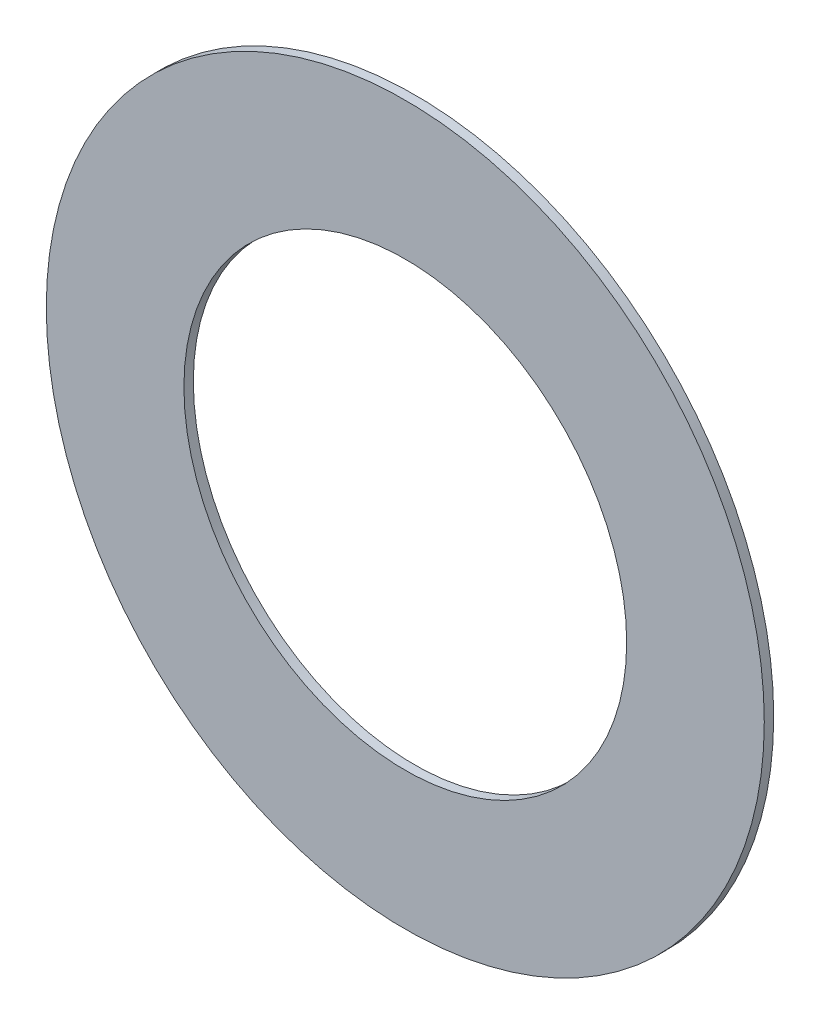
ISO-10303-21;
HEADER;
FILE_DESCRIPTION(('STEP AP214'),'2;1');
FILE_NAME('part.step','',(''),(''),'','','');
FILE_SCHEMA(('AUTOMOTIVE_DESIGN { 1 0 10303 214 1 1 1 1 }'));
ENDSEC;
DATA;
#1=APPLICATION_CONTEXT('core data for automotive mechanical design processes');
#2=APPLICATION_PROTOCOL_DEFINITION('international standard','automotive_design',2000,#1);
#3=PRODUCT_CONTEXT('',#1,'mechanical');
#4=PRODUCT('Part','Part','',(#3));
#5=PRODUCT_RELATED_PRODUCT_CATEGORY('part','',(#4));
#6=PRODUCT_DEFINITION_FORMATION('','',#4);
#7=PRODUCT_DEFINITION_CONTEXT('part definition',#1,'design');
#8=PRODUCT_DEFINITION('design','',#6,#7);
#9=PRODUCT_DEFINITION_SHAPE('','',#8);
#10=(LENGTH_UNIT() NAMED_UNIT(*) SI_UNIT(.MILLI.,.METRE.));
#11=(NAMED_UNIT(*) PLANE_ANGLE_UNIT() SI_UNIT($,.RADIAN.));
#12=(NAMED_UNIT(*) SI_UNIT($,.STERADIAN.) SOLID_ANGLE_UNIT());
#13=UNCERTAINTY_MEASURE_WITH_UNIT(LENGTH_MEASURE(1.E-05),#10,'distance_accuracy_value','');
#14=(GEOMETRIC_REPRESENTATION_CONTEXT(3) GLOBAL_UNCERTAINTY_ASSIGNED_CONTEXT((#13)) GLOBAL_UNIT_ASSIGNED_CONTEXT((#10,
#11,#12)) REPRESENTATION_CONTEXT('',''));
#15=CARTESIAN_POINT('',(0.,0.,0.));
#16=DIRECTION('',(0.,0.,1.));
#17=DIRECTION('',(1.,0.,0.));
#18=AXIS2_PLACEMENT_3D('',#15,#16,#17);
#19=CARTESIAN_POINT('',(0.,0.,1.));
#20=DIRECTION('',(0.,0.,1.));
#21=DIRECTION('',(1.,0.,0.));
#22=AXIS2_PLACEMENT_3D('',#19,#20,#21);
#23=PLANE('',#22);
#24=CARTESIAN_POINT('',(0.,0.,1.));
#25=DIRECTION('',(0.,0.,1.));
#26=DIRECTION('',(1.,0.,0.));
#27=AXIS2_PLACEMENT_3D('',#24,#25,#26);
#28=CIRCLE('',#27,38.1);
#29=CARTESIAN_POINT('',(38.1,0.,1.));
#30=VERTEX_POINT('',#29);
#31=EDGE_CURVE('E12',#30,#30,#28,.T.);
#32=ORIENTED_EDGE('',*,*,#31,.T.);
#33=EDGE_LOOP('',(#32));
#34=FACE_BOUND('',#33,.T.);
#35=CARTESIAN_POINT('',(0.,0.,1.));
#36=DIRECTION('',(0.,0.,1.));
#37=DIRECTION('',(1.,0.,0.));
#38=AXIS2_PLACEMENT_3D('',#35,#36,#37);
#39=CIRCLE('',#38,23.495);
#40=CARTESIAN_POINT('',(23.495,0.,1.));
#41=VERTEX_POINT('',#40);
#42=EDGE_CURVE('E51',#41,#41,#39,.T.);
#43=ORIENTED_EDGE('',*,*,#42,.F.);
#44=EDGE_LOOP('',(#43));
#45=FACE_BOUND('',#44,.T.);
#46=ADVANCED_FACE('F40',(#34,#45),#23,.T.);
#47=CARTESIAN_POINT('',(0.,0.,0.));
#48=DIRECTION('',(0.,0.,1.));
#49=DIRECTION('',(1.,0.,0.));
#50=AXIS2_PLACEMENT_3D('',#47,#48,#49);
#51=PLANE('',#50);
#52=CARTESIAN_POINT('',(0.,0.,0.));
#53=DIRECTION('',(0.,0.,1.));
#54=DIRECTION('',(1.,0.,0.));
#55=AXIS2_PLACEMENT_3D('',#52,#53,#54);
#56=CIRCLE('',#55,38.1);
#57=CARTESIAN_POINT('',(38.1,0.,0.));
#58=VERTEX_POINT('',#57);
#59=EDGE_CURVE('E44',#58,#58,#56,.T.);
#60=ORIENTED_EDGE('',*,*,#59,.F.);
#61=EDGE_LOOP('',(#60));
#62=FACE_BOUND('',#61,.T.);
#63=CARTESIAN_POINT('',(0.,0.,0.));
#64=DIRECTION('',(0.,0.,1.));
#65=DIRECTION('',(1.,0.,0.));
#66=AXIS2_PLACEMENT_3D('',#63,#64,#65);
#67=CIRCLE('',#66,23.495);
#68=CARTESIAN_POINT('',(23.495,0.,0.));
#69=VERTEX_POINT('',#68);
#70=EDGE_CURVE('E53',#69,#69,#67,.T.);
#71=ORIENTED_EDGE('',*,*,#70,.T.);
#72=EDGE_LOOP('',(#71));
#73=FACE_BOUND('',#72,.T.);
#74=ADVANCED_FACE('F63',(#62,#73),#51,.F.);
#75=CARTESIAN_POINT('',(0.,0.,1.));
#76=DIRECTION('',(0.,0.,-1.));
#77=DIRECTION('',(-1.,0.,0.));
#78=AXIS2_PLACEMENT_3D('',#75,#76,#77);
#79=CYLINDRICAL_SURFACE('',#78,38.1);
#80=ORIENTED_EDGE('',*,*,#31,.F.);
#81=EDGE_LOOP('',(#80));
#82=FACE_BOUND('',#81,.T.);
#83=ORIENTED_EDGE('',*,*,#59,.T.);
#84=EDGE_LOOP('',(#83));
#85=FACE_BOUND('',#84,.T.);
#86=ADVANCED_FACE('F42',(#82,#85),#79,.T.);
#87=CARTESIAN_POINT('',(0.,0.,1.));
#88=DIRECTION('',(0.,0.,-1.));
#89=DIRECTION('',(-1.,0.,0.));
#90=AXIS2_PLACEMENT_3D('',#87,#88,#89);
#91=CYLINDRICAL_SURFACE('',#90,23.495);
#92=ORIENTED_EDGE('',*,*,#42,.T.);
#93=EDGE_LOOP('',(#92));
#94=FACE_BOUND('',#93,.T.);
#95=ORIENTED_EDGE('',*,*,#70,.F.);
#96=EDGE_LOOP('',(#95));
#97=FACE_BOUND('',#96,.T.);
#98=ADVANCED_FACE('F59',(#94,#97),#91,.F.);
#99=CLOSED_SHELL('',(#46,#74,#86,#98));
#100=MANIFOLD_SOLID_BREP('B2',#99);
#101=ADVANCED_BREP_SHAPE_REPRESENTATION('',(#18,#100),#14);
#102=SHAPE_DEFINITION_REPRESENTATION(#9,#101);
ENDSEC;
END-ISO-10303-21;
